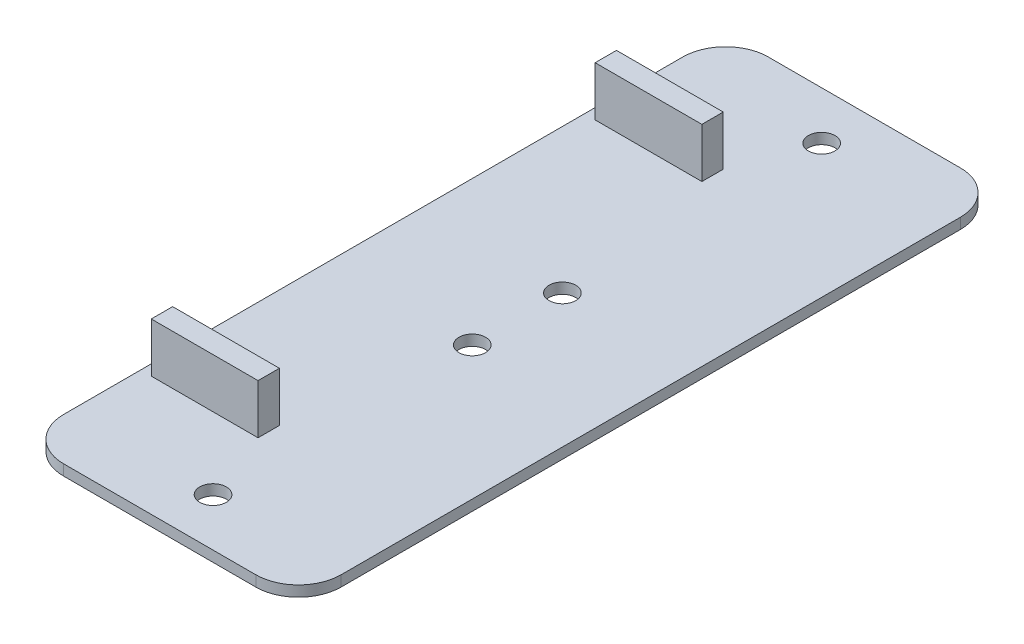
ISO-10303-21;
HEADER;
FILE_DESCRIPTION(('STEP AP214'),'2;1');
FILE_NAME('part.step','',(''),(''),'','','');
FILE_SCHEMA(('AUTOMOTIVE_DESIGN { 1 0 10303 214 1 1 1 1 }'));
ENDSEC;
DATA;
#1=APPLICATION_CONTEXT('core data for automotive mechanical design processes');
#2=APPLICATION_PROTOCOL_DEFINITION('international standard','automotive_design',2000,#1);
#3=PRODUCT_CONTEXT('',#1,'mechanical');
#4=PRODUCT('Part','Part','',(#3));
#5=PRODUCT_RELATED_PRODUCT_CATEGORY('part','',(#4));
#6=PRODUCT_DEFINITION_FORMATION('','',#4);
#7=PRODUCT_DEFINITION_CONTEXT('part definition',#1,'design');
#8=PRODUCT_DEFINITION('design','',#6,#7);
#9=PRODUCT_DEFINITION_SHAPE('','',#8);
#10=(LENGTH_UNIT() NAMED_UNIT(*) SI_UNIT(.MILLI.,.METRE.));
#11=(NAMED_UNIT(*) PLANE_ANGLE_UNIT() SI_UNIT($,.RADIAN.));
#12=(NAMED_UNIT(*) SI_UNIT($,.STERADIAN.) SOLID_ANGLE_UNIT());
#13=UNCERTAINTY_MEASURE_WITH_UNIT(LENGTH_MEASURE(1.E-05),#10,'distance_accuracy_value','');
#14=(GEOMETRIC_REPRESENTATION_CONTEXT(3) GLOBAL_UNCERTAINTY_ASSIGNED_CONTEXT((#13)) GLOBAL_UNIT_ASSIGNED_CONTEXT((#10,
#11,#12)) REPRESENTATION_CONTEXT('',''));
#15=CARTESIAN_POINT('',(0.,0.,0.));
#16=DIRECTION('',(0.,0.,1.));
#17=DIRECTION('',(1.,0.,0.));
#18=AXIS2_PLACEMENT_3D('',#15,#16,#17);
#19=CARTESIAN_POINT('',(0.,1.27,0.));
#20=DIRECTION('',(0.,-1.,0.));
#21=DIRECTION('',(0.,0.,-1.));
#22=AXIS2_PLACEMENT_3D('',#19,#20,#21);
#23=PLANE('',#22);
#24=DIRECTION('',(0.,0.,-1.));
#25=VECTOR('',#24,1.);
#26=CARTESIAN_POINT('',(13.97,1.27,-14.2430500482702));
#27=LINE('',#26,#25);
#28=CARTESIAN_POINT('',(13.97,1.27,-14.2430500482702));
#29=VERTEX_POINT('',#28);
#30=CARTESIAN_POINT('',(13.97,1.27,-16.7830500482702));
#31=VERTEX_POINT('',#30);
#32=EDGE_CURVE('E155',#29,#31,#27,.T.);
#33=ORIENTED_EDGE('',*,*,#32,.F.);
#34=DIRECTION('',(1.,0.,0.));
#35=VECTOR('',#34,1.);
#36=CARTESIAN_POINT('',(1.27,1.27,-14.2430500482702));
#37=LINE('',#36,#35);
#38=CARTESIAN_POINT('',(1.27,1.27,-14.2430500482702));
#39=VERTEX_POINT('',#38);
#40=EDGE_CURVE('E188',#39,#29,#37,.T.);
#41=ORIENTED_EDGE('',*,*,#40,.F.);
#42=DIRECTION('',(0.,0.,1.));
#43=VECTOR('',#42,1.);
#44=CARTESIAN_POINT('',(1.27,1.27,-16.7830500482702));
#45=LINE('',#44,#43);
#46=CARTESIAN_POINT('',(1.27,1.27,-16.7830500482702));
#47=VERTEX_POINT('',#46);
#48=EDGE_CURVE('E200',#47,#39,#45,.T.);
#49=ORIENTED_EDGE('',*,*,#48,.F.);
#50=DIRECTION('',(-1.,0.,0.));
#51=VECTOR('',#50,1.);
#52=CARTESIAN_POINT('',(13.97,1.27,-16.7830500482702));
#53=LINE('',#52,#51);
#54=EDGE_CURVE('E197',#31,#47,#53,.T.);
#55=ORIENTED_EDGE('',*,*,#54,.F.);
#56=EDGE_LOOP('',(#33,#41,#49,#55));
#57=FACE_BOUND('',#56,.T.);
#58=CARTESIAN_POINT('',(17.145,1.27,-78.105));
#59=DIRECTION('',(0.,-1.,0.));
#60=DIRECTION('',(0.,0.,-1.));
#61=AXIS2_PLACEMENT_3D('',#58,#59,#60);
#62=CIRCLE('',#61,1.5875);
#63=CARTESIAN_POINT('',(17.145,1.27,-79.6925));
#64=VERTEX_POINT('',#63);
#65=EDGE_CURVE('E237',#64,#64,#62,.F.);
#66=ORIENTED_EDGE('',*,*,#65,.F.);
#67=EDGE_LOOP('',(#66));
#68=FACE_BOUND('',#67,.T.);
#69=CARTESIAN_POINT('',(17.145,1.27,-47.2694));
#70=DIRECTION('',(0.,-1.,0.));
#71=DIRECTION('',(0.,0.,-1.));
#72=AXIS2_PLACEMENT_3D('',#69,#70,#71);
#73=CIRCLE('',#72,1.5875);
#74=CARTESIAN_POINT('',(17.145,1.27,-48.8569));
#75=VERTEX_POINT('',#74);
#76=EDGE_CURVE('E234',#75,#75,#73,.F.);
#77=ORIENTED_EDGE('',*,*,#76,.F.);
#78=EDGE_LOOP('',(#77));
#79=FACE_BOUND('',#78,.T.);
#80=CARTESIAN_POINT('',(17.145,1.27,-36.5506000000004));
#81=DIRECTION('',(0.,-1.,0.));
#82=DIRECTION('',(0.,0.,-1.));
#83=AXIS2_PLACEMENT_3D('',#80,#81,#82);
#84=CIRCLE('',#83,1.5875);
#85=CARTESIAN_POINT('',(17.145,1.27,-38.1381000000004));
#86=VERTEX_POINT('',#85);
#87=EDGE_CURVE('E231',#86,#86,#84,.F.);
#88=ORIENTED_EDGE('',*,*,#87,.F.);
#89=EDGE_LOOP('',(#88));
#90=FACE_BOUND('',#89,.T.);
#91=CARTESIAN_POINT('',(17.145,1.27,-5.71500000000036));
#92=DIRECTION('',(0.,-1.,0.));
#93=DIRECTION('',(0.,0.,-1.));
#94=AXIS2_PLACEMENT_3D('',#91,#92,#93);
#95=CIRCLE('',#94,1.5875);
#96=CARTESIAN_POINT('',(17.145,1.27,-7.30250000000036));
#97=VERTEX_POINT('',#96);
#98=EDGE_CURVE('E220',#97,#97,#95,.F.);
#99=ORIENTED_EDGE('',*,*,#98,.F.);
#100=EDGE_LOOP('',(#99));
#101=FACE_BOUND('',#100,.T.);
#102=DIRECTION('',(-1.,0.,0.));
#103=VECTOR('',#102,1.);
#104=CARTESIAN_POINT('',(0.,1.27,-83.82));
#105=LINE('',#104,#103);
#106=CARTESIAN_POINT('',(27.94,1.27,-83.82));
#107=VERTEX_POINT('',#106);
#108=CARTESIAN_POINT('',(5.08,1.27,-83.82));
#109=VERTEX_POINT('',#108);
#110=EDGE_CURVE('E250',#107,#109,#105,.T.);
#111=ORIENTED_EDGE('',*,*,#110,.T.);
#112=CARTESIAN_POINT('',(5.08,1.27,-78.74));
#113=DIRECTION('',(0.,-1.,0.));
#114=DIRECTION('',(0.,0.,-1.));
#115=AXIS2_PLACEMENT_3D('',#112,#113,#114);
#116=CIRCLE('',#115,5.08);
#117=CARTESIAN_POINT('',(0.,1.27,-78.74));
#118=VERTEX_POINT('',#117);
#119=EDGE_CURVE('E11',#109,#118,#116,.F.);
#120=ORIENTED_EDGE('',*,*,#119,.T.);
#121=DIRECTION('',(0.,0.,1.));
#122=VECTOR('',#121,1.);
#123=CARTESIAN_POINT('',(0.,1.27,0.));
#124=LINE('',#123,#122);
#125=CARTESIAN_POINT('',(0.,1.27,-5.08));
#126=VERTEX_POINT('',#125);
#127=EDGE_CURVE('E241',#118,#126,#124,.T.);
#128=ORIENTED_EDGE('',*,*,#127,.T.);
#129=CARTESIAN_POINT('',(5.08,1.27,-5.08));
#130=DIRECTION('',(0.,-1.,0.));
#131=DIRECTION('',(0.,0.,-1.));
#132=AXIS2_PLACEMENT_3D('',#129,#130,#131);
#133=CIRCLE('',#132,5.08);
#134=CARTESIAN_POINT('',(5.08,1.27,0.));
#135=VERTEX_POINT('',#134);
#136=EDGE_CURVE('E268',#126,#135,#133,.F.);
#137=ORIENTED_EDGE('',*,*,#136,.T.);
#138=DIRECTION('',(1.,0.,0.));
#139=VECTOR('',#138,1.);
#140=CARTESIAN_POINT('',(0.,1.27,0.));
#141=LINE('',#140,#139);
#142=CARTESIAN_POINT('',(27.94,1.27,0.));
#143=VERTEX_POINT('',#142);
#144=EDGE_CURVE('E243',#135,#143,#141,.T.);
#145=ORIENTED_EDGE('',*,*,#144,.T.);
#146=CARTESIAN_POINT('',(27.94,1.27,-5.08));
#147=DIRECTION('',(0.,-1.,0.));
#148=DIRECTION('',(0.,0.,-1.));
#149=AXIS2_PLACEMENT_3D('',#146,#147,#148);
#150=CIRCLE('',#149,5.08);
#151=CARTESIAN_POINT('',(33.02,1.27,-5.08));
#152=VERTEX_POINT('',#151);
#153=EDGE_CURVE('E281',#143,#152,#150,.F.);
#154=ORIENTED_EDGE('',*,*,#153,.T.);
#155=DIRECTION('',(0.,0.,-1.));
#156=VECTOR('',#155,1.);
#157=CARTESIAN_POINT('',(33.02,1.27,0.));
#158=LINE('',#157,#156);
#159=CARTESIAN_POINT('',(33.02,1.27,-78.74));
#160=VERTEX_POINT('',#159);
#161=EDGE_CURVE('E247',#152,#160,#158,.T.);
#162=ORIENTED_EDGE('',*,*,#161,.T.);
#163=CARTESIAN_POINT('',(27.94,1.27,-78.74));
#164=DIRECTION('',(0.,-1.,0.));
#165=DIRECTION('',(0.,0.,-1.));
#166=AXIS2_PLACEMENT_3D('',#163,#164,#165);
#167=CIRCLE('',#166,5.08);
#168=EDGE_CURVE('E291',#160,#107,#167,.F.);
#169=ORIENTED_EDGE('',*,*,#168,.T.);
#170=EDGE_LOOP('',(#111,#120,#128,#137,#145,#154,#162,#169));
#171=FACE_BOUND('',#170,.T.);
#172=DIRECTION('',(1.,0.,0.));
#173=VECTOR('',#172,1.);
#174=CARTESIAN_POINT('',(1.27,1.27,-67.03695));
#175=LINE('',#174,#173);
#176=CARTESIAN_POINT('',(1.27,1.27,-67.03695));
#177=VERTEX_POINT('',#176);
#178=CARTESIAN_POINT('',(13.97,1.27,-67.03695));
#179=VERTEX_POINT('',#178);
#180=EDGE_CURVE('E149',#177,#179,#175,.T.);
#181=ORIENTED_EDGE('',*,*,#180,.F.);
#182=DIRECTION('',(0.,0.,1.));
#183=VECTOR('',#182,1.);
#184=CARTESIAN_POINT('',(1.27,1.27,-69.57695));
#185=LINE('',#184,#183);
#186=CARTESIAN_POINT('',(1.27,1.27,-69.57695));
#187=VERTEX_POINT('',#186);
#188=EDGE_CURVE('E151',#187,#177,#185,.T.);
#189=ORIENTED_EDGE('',*,*,#188,.F.);
#190=DIRECTION('',(-1.,0.,0.));
#191=VECTOR('',#190,1.);
#192=CARTESIAN_POINT('',(13.97,1.27,-69.57695));
#193=LINE('',#192,#191);
#194=CARTESIAN_POINT('',(13.97,1.27,-69.57695));
#195=VERTEX_POINT('',#194);
#196=EDGE_CURVE('E61',#195,#187,#193,.T.);
#197=ORIENTED_EDGE('',*,*,#196,.F.);
#198=DIRECTION('',(0.,0.,-1.));
#199=VECTOR('',#198,1.);
#200=CARTESIAN_POINT('',(13.97,1.27,-67.03695));
#201=LINE('',#200,#199);
#202=EDGE_CURVE('E56',#179,#195,#201,.T.);
#203=ORIENTED_EDGE('',*,*,#202,.F.);
#204=EDGE_LOOP('',(#181,#189,#197,#203));
#205=FACE_BOUND('',#204,.T.);
#206=ADVANCED_FACE('F41',(#57,#68,#79,#90,#101,#171,#205),#23,.F.);
#207=CARTESIAN_POINT('',(5.08,1.27,-78.74));
#208=DIRECTION('',(0.,1.,0.));
#209=DIRECTION('',(0.,0.,1.));
#210=AXIS2_PLACEMENT_3D('',#207,#208,#209);
#211=CYLINDRICAL_SURFACE('',#210,5.08);
#212=DIRECTION('',(0.,1.,0.));
#213=VECTOR('',#212,1.);
#214=CARTESIAN_POINT('',(5.08,1.27,-83.82));
#215=LINE('',#214,#213);
#216=CARTESIAN_POINT('',(5.08,0.,-83.82));
#217=VERTEX_POINT('',#216);
#218=EDGE_CURVE('E293',#217,#109,#215,.T.);
#219=ORIENTED_EDGE('',*,*,#218,.F.);
#220=CARTESIAN_POINT('',(5.08,0.,-78.74));
#221=DIRECTION('',(0.,-1.,0.));
#222=DIRECTION('',(0.,0.,-1.));
#223=AXIS2_PLACEMENT_3D('',#220,#221,#222);
#224=CIRCLE('',#223,5.08);
#225=CARTESIAN_POINT('',(0.,0.,-78.74));
#226=VERTEX_POINT('',#225);
#227=EDGE_CURVE('E49',#226,#217,#224,.T.);
#228=ORIENTED_EDGE('',*,*,#227,.F.);
#229=DIRECTION('',(0.,1.,0.));
#230=VECTOR('',#229,1.);
#231=CARTESIAN_POINT('',(0.,1.27,-78.74));
#232=LINE('',#231,#230);
#233=EDGE_CURVE('E296',#118,#226,#232,.F.);
#234=ORIENTED_EDGE('',*,*,#233,.F.);
#235=ORIENTED_EDGE('',*,*,#119,.F.);
#236=EDGE_LOOP('',(#219,#228,#234,#235));
#237=FACE_BOUND('',#236,.T.);
#238=ADVANCED_FACE('F43',(#237),#211,.T.);
#239=CARTESIAN_POINT('',(27.94,1.27,-78.74));
#240=DIRECTION('',(0.,1.,0.));
#241=DIRECTION('',(0.,0.,1.));
#242=AXIS2_PLACEMENT_3D('',#239,#240,#241);
#243=CYLINDRICAL_SURFACE('',#242,5.08);
#244=DIRECTION('',(0.,1.,0.));
#245=VECTOR('',#244,1.);
#246=CARTESIAN_POINT('',(33.02,1.27,-78.74));
#247=LINE('',#246,#245);
#248=CARTESIAN_POINT('',(33.02,0.,-78.74));
#249=VERTEX_POINT('',#248);
#250=EDGE_CURVE('E283',#249,#160,#247,.T.);
#251=ORIENTED_EDGE('',*,*,#250,.F.);
#252=CARTESIAN_POINT('',(27.94,0.,-78.74));
#253=DIRECTION('',(0.,-1.,0.));
#254=DIRECTION('',(0.,0.,-1.));
#255=AXIS2_PLACEMENT_3D('',#252,#253,#254);
#256=CIRCLE('',#255,5.08);
#257=CARTESIAN_POINT('',(27.94,0.,-83.82));
#258=VERTEX_POINT('',#257);
#259=EDGE_CURVE('E289',#258,#249,#256,.T.);
#260=ORIENTED_EDGE('',*,*,#259,.F.);
#261=DIRECTION('',(0.,1.,0.));
#262=VECTOR('',#261,1.);
#263=CARTESIAN_POINT('',(27.94,1.27,-83.82));
#264=LINE('',#263,#262);
#265=EDGE_CURVE('E286',#107,#258,#264,.F.);
#266=ORIENTED_EDGE('',*,*,#265,.F.);
#267=ORIENTED_EDGE('',*,*,#168,.F.);
#268=EDGE_LOOP('',(#251,#260,#266,#267));
#269=FACE_BOUND('',#268,.T.);
#270=ADVANCED_FACE('F311',(#269),#243,.T.);
#271=CARTESIAN_POINT('',(27.94,1.27,-5.08));
#272=DIRECTION('',(0.,1.,0.));
#273=DIRECTION('',(0.,0.,1.));
#274=AXIS2_PLACEMENT_3D('',#271,#272,#273);
#275=CYLINDRICAL_SURFACE('',#274,5.08);
#276=DIRECTION('',(0.,1.,0.));
#277=VECTOR('',#276,1.);
#278=CARTESIAN_POINT('',(27.94,1.27,0.));
#279=LINE('',#278,#277);
#280=CARTESIAN_POINT('',(27.94,0.,0.));
#281=VERTEX_POINT('',#280);
#282=EDGE_CURVE('E273',#281,#143,#279,.T.);
#283=ORIENTED_EDGE('',*,*,#282,.F.);
#284=CARTESIAN_POINT('',(27.94,0.,-5.08));
#285=DIRECTION('',(0.,-1.,0.));
#286=DIRECTION('',(0.,0.,-1.));
#287=AXIS2_PLACEMENT_3D('',#284,#285,#286);
#288=CIRCLE('',#287,5.08);
#289=CARTESIAN_POINT('',(33.02,0.,-5.08));
#290=VERTEX_POINT('',#289);
#291=EDGE_CURVE('E279',#290,#281,#288,.T.);
#292=ORIENTED_EDGE('',*,*,#291,.F.);
#293=DIRECTION('',(0.,1.,0.));
#294=VECTOR('',#293,1.);
#295=CARTESIAN_POINT('',(33.02,1.27,-5.08));
#296=LINE('',#295,#294);
#297=EDGE_CURVE('E276',#152,#290,#296,.F.);
#298=ORIENTED_EDGE('',*,*,#297,.F.);
#299=ORIENTED_EDGE('',*,*,#153,.F.);
#300=EDGE_LOOP('',(#283,#292,#298,#299));
#301=FACE_BOUND('',#300,.T.);
#302=ADVANCED_FACE('F320',(#301),#275,.T.);
#303=CARTESIAN_POINT('',(5.08,1.27,-5.08));
#304=DIRECTION('',(0.,-1.,0.));
#305=DIRECTION('',(0.,0.,-1.));
#306=AXIS2_PLACEMENT_3D('',#303,#304,#305);
#307=CYLINDRICAL_SURFACE('',#306,5.08);
#308=DIRECTION('',(0.,-1.,0.));
#309=VECTOR('',#308,1.);
#310=CARTESIAN_POINT('',(5.08,1.27,0.));
#311=LINE('',#310,#309);
#312=CARTESIAN_POINT('',(5.08,0.,0.));
#313=VERTEX_POINT('',#312);
#314=EDGE_CURVE('E253',#135,#313,#311,.T.);
#315=ORIENTED_EDGE('',*,*,#314,.F.);
#316=ORIENTED_EDGE('',*,*,#136,.F.);
#317=DIRECTION('',(0.,-1.,0.));
#318=VECTOR('',#317,1.);
#319=CARTESIAN_POINT('',(0.,1.27,-5.08));
#320=LINE('',#319,#318);
#321=CARTESIAN_POINT('',(0.,0.,-5.08));
#322=VERTEX_POINT('',#321);
#323=EDGE_CURVE('E265',#322,#126,#320,.F.);
#324=ORIENTED_EDGE('',*,*,#323,.F.);
#325=CARTESIAN_POINT('',(5.08,0.,-5.08));
#326=DIRECTION('',(0.,-1.,0.));
#327=DIRECTION('',(0.,0.,-1.));
#328=AXIS2_PLACEMENT_3D('',#325,#326,#327);
#329=CIRCLE('',#328,5.08);
#330=EDGE_CURVE('E270',#313,#322,#329,.T.);
#331=ORIENTED_EDGE('',*,*,#330,.F.);
#332=EDGE_LOOP('',(#315,#316,#324,#331));
#333=FACE_BOUND('',#332,.T.);
#334=ADVANCED_FACE('F328',(#333),#307,.T.);
#335=CARTESIAN_POINT('',(0.,1.27,0.));
#336=DIRECTION('',(1.,0.,0.));
#337=DIRECTION('',(0.,0.,-1.));
#338=AXIS2_PLACEMENT_3D('',#335,#336,#337);
#339=PLANE('',#338);
#340=ORIENTED_EDGE('',*,*,#127,.F.);
#341=ORIENTED_EDGE('',*,*,#233,.T.);
#342=DIRECTION('',(0.,0.,1.));
#343=VECTOR('',#342,1.);
#344=CARTESIAN_POINT('',(0.,0.,0.));
#345=LINE('',#344,#343);
#346=EDGE_CURVE('E240',#226,#322,#345,.T.);
#347=ORIENTED_EDGE('',*,*,#346,.T.);
#348=ORIENTED_EDGE('',*,*,#323,.T.);
#349=EDGE_LOOP('',(#340,#341,#347,#348));
#350=FACE_BOUND('',#349,.T.);
#351=ADVANCED_FACE('F331',(#350),#339,.F.);
#352=CARTESIAN_POINT('',(0.,1.27,0.));
#353=DIRECTION('',(0.,0.,-1.));
#354=DIRECTION('',(-1.,0.,0.));
#355=AXIS2_PLACEMENT_3D('',#352,#353,#354);
#356=PLANE('',#355);
#357=DIRECTION('',(1.,0.,0.));
#358=VECTOR('',#357,1.);
#359=CARTESIAN_POINT('',(0.,0.,0.));
#360=LINE('',#359,#358);
#361=EDGE_CURVE('E255',#313,#281,#360,.T.);
#362=ORIENTED_EDGE('',*,*,#361,.T.);
#363=ORIENTED_EDGE('',*,*,#282,.T.);
#364=ORIENTED_EDGE('',*,*,#144,.F.);
#365=ORIENTED_EDGE('',*,*,#314,.T.);
#366=EDGE_LOOP('',(#362,#363,#364,#365));
#367=FACE_BOUND('',#366,.T.);
#368=ADVANCED_FACE('F323',(#367),#356,.F.);
#369=CARTESIAN_POINT('',(33.02,1.27,0.));
#370=DIRECTION('',(-1.,0.,0.));
#371=DIRECTION('',(0.,0.,1.));
#372=AXIS2_PLACEMENT_3D('',#369,#370,#371);
#373=PLANE('',#372);
#374=DIRECTION('',(0.,0.,-1.));
#375=VECTOR('',#374,1.);
#376=CARTESIAN_POINT('',(33.02,0.,0.));
#377=LINE('',#376,#375);
#378=EDGE_CURVE('E258',#290,#249,#377,.T.);
#379=ORIENTED_EDGE('',*,*,#378,.T.);
#380=ORIENTED_EDGE('',*,*,#250,.T.);
#381=ORIENTED_EDGE('',*,*,#161,.F.);
#382=ORIENTED_EDGE('',*,*,#297,.T.);
#383=EDGE_LOOP('',(#379,#380,#381,#382));
#384=FACE_BOUND('',#383,.T.);
#385=ADVANCED_FACE('F316',(#384),#373,.F.);
#386=CARTESIAN_POINT('',(0.,1.27,-83.82));
#387=DIRECTION('',(0.,0.,1.));
#388=DIRECTION('',(1.,0.,0.));
#389=AXIS2_PLACEMENT_3D('',#386,#387,#388);
#390=PLANE('',#389);
#391=DIRECTION('',(-1.,0.,0.));
#392=VECTOR('',#391,1.);
#393=CARTESIAN_POINT('',(0.,0.,-83.82));
#394=LINE('',#393,#392);
#395=EDGE_CURVE('E244',#258,#217,#394,.T.);
#396=ORIENTED_EDGE('',*,*,#395,.T.);
#397=ORIENTED_EDGE('',*,*,#218,.T.);
#398=ORIENTED_EDGE('',*,*,#110,.F.);
#399=ORIENTED_EDGE('',*,*,#265,.T.);
#400=EDGE_LOOP('',(#396,#397,#398,#399));
#401=FACE_BOUND('',#400,.T.);
#402=ADVANCED_FACE('F307',(#401),#390,.F.);
#403=CARTESIAN_POINT('',(0.,0.,0.));
#404=DIRECTION('',(0.,-1.,0.));
#405=DIRECTION('',(0.,0.,-1.));
#406=AXIS2_PLACEMENT_3D('',#403,#404,#405);
#407=PLANE('',#406);
#408=CARTESIAN_POINT('',(17.145,0.,-78.105));
#409=DIRECTION('',(0.,-1.,0.));
#410=DIRECTION('',(0.,0.,-1.));
#411=AXIS2_PLACEMENT_3D('',#408,#409,#410);
#412=CIRCLE('',#411,1.5875);
#413=CARTESIAN_POINT('',(17.145,0.,-79.6925));
#414=VERTEX_POINT('',#413);
#415=EDGE_CURVE('E217',#414,#414,#412,.T.);
#416=ORIENTED_EDGE('',*,*,#415,.F.);
#417=EDGE_LOOP('',(#416));
#418=FACE_BOUND('',#417,.T.);
#419=CARTESIAN_POINT('',(17.145,0.,-47.2694));
#420=DIRECTION('',(0.,-1.,0.));
#421=DIRECTION('',(0.,0.,-1.));
#422=AXIS2_PLACEMENT_3D('',#419,#420,#421);
#423=CIRCLE('',#422,1.5875);
#424=CARTESIAN_POINT('',(17.145,0.,-48.8569));
#425=VERTEX_POINT('',#424);
#426=EDGE_CURVE('E221',#425,#425,#423,.T.);
#427=ORIENTED_EDGE('',*,*,#426,.F.);
#428=EDGE_LOOP('',(#427));
#429=FACE_BOUND('',#428,.T.);
#430=CARTESIAN_POINT('',(17.145,0.,-36.5506000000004));
#431=DIRECTION('',(0.,-1.,0.));
#432=DIRECTION('',(0.,0.,-1.));
#433=AXIS2_PLACEMENT_3D('',#430,#431,#432);
#434=CIRCLE('',#433,1.5875);
#435=CARTESIAN_POINT('',(17.145,0.,-38.1381000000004));
#436=VERTEX_POINT('',#435);
#437=EDGE_CURVE('E224',#436,#436,#434,.T.);
#438=ORIENTED_EDGE('',*,*,#437,.F.);
#439=EDGE_LOOP('',(#438));
#440=FACE_BOUND('',#439,.T.);
#441=CARTESIAN_POINT('',(17.145,0.,-5.71500000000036));
#442=DIRECTION('',(0.,-1.,0.));
#443=DIRECTION('',(0.,0.,-1.));
#444=AXIS2_PLACEMENT_3D('',#441,#442,#443);
#445=CIRCLE('',#444,1.5875);
#446=CARTESIAN_POINT('',(17.145,0.,-7.30250000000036));
#447=VERTEX_POINT('',#446);
#448=EDGE_CURVE('E216',#447,#447,#445,.T.);
#449=ORIENTED_EDGE('',*,*,#448,.F.);
#450=EDGE_LOOP('',(#449));
#451=FACE_BOUND('',#450,.T.);
#452=ORIENTED_EDGE('',*,*,#346,.F.);
#453=ORIENTED_EDGE('',*,*,#227,.T.);
#454=ORIENTED_EDGE('',*,*,#395,.F.);
#455=ORIENTED_EDGE('',*,*,#259,.T.);
#456=ORIENTED_EDGE('',*,*,#378,.F.);
#457=ORIENTED_EDGE('',*,*,#291,.T.);
#458=ORIENTED_EDGE('',*,*,#361,.F.);
#459=ORIENTED_EDGE('',*,*,#330,.T.);
#460=EDGE_LOOP('',(#452,#453,#454,#455,#456,#457,#458,#459));
#461=FACE_BOUND('',#460,.T.);
#462=ADVANCED_FACE('F302',(#418,#429,#440,#451,#461),#407,.T.);
#463=CARTESIAN_POINT('',(17.145,0.,-5.71500000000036));
#464=DIRECTION('',(0.,1.,0.));
#465=DIRECTION('',(0.,0.,1.));
#466=AXIS2_PLACEMENT_3D('',#463,#464,#465);
#467=CYLINDRICAL_SURFACE('',#466,1.5875);
#468=ORIENTED_EDGE('',*,*,#448,.T.);
#469=EDGE_LOOP('',(#468));
#470=FACE_BOUND('',#469,.T.);
#471=ORIENTED_EDGE('',*,*,#98,.T.);
#472=EDGE_LOOP('',(#471));
#473=FACE_BOUND('',#472,.T.);
#474=ADVANCED_FACE('F342',(#470,#473),#467,.F.);
#475=CARTESIAN_POINT('',(17.145,0.,-36.5506000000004));
#476=DIRECTION('',(0.,1.,0.));
#477=DIRECTION('',(0.,0.,1.));
#478=AXIS2_PLACEMENT_3D('',#475,#476,#477);
#479=CYLINDRICAL_SURFACE('',#478,1.5875);
#480=ORIENTED_EDGE('',*,*,#437,.T.);
#481=EDGE_LOOP('',(#480));
#482=FACE_BOUND('',#481,.T.);
#483=ORIENTED_EDGE('',*,*,#87,.T.);
#484=EDGE_LOOP('',(#483));
#485=FACE_BOUND('',#484,.T.);
#486=ADVANCED_FACE('F398',(#482,#485),#479,.F.);
#487=CARTESIAN_POINT('',(17.145,0.,-47.2694));
#488=DIRECTION('',(0.,1.,0.));
#489=DIRECTION('',(0.,0.,1.));
#490=AXIS2_PLACEMENT_3D('',#487,#488,#489);
#491=CYLINDRICAL_SURFACE('',#490,1.5875);
#492=ORIENTED_EDGE('',*,*,#426,.T.);
#493=EDGE_LOOP('',(#492));
#494=FACE_BOUND('',#493,.T.);
#495=ORIENTED_EDGE('',*,*,#76,.T.);
#496=EDGE_LOOP('',(#495));
#497=FACE_BOUND('',#496,.T.);
#498=ADVANCED_FACE('F405',(#494,#497),#491,.F.);
#499=CARTESIAN_POINT('',(17.145,0.,-78.105));
#500=DIRECTION('',(0.,1.,0.));
#501=DIRECTION('',(0.,0.,1.));
#502=AXIS2_PLACEMENT_3D('',#499,#500,#501);
#503=CYLINDRICAL_SURFACE('',#502,1.5875);
#504=ORIENTED_EDGE('',*,*,#415,.T.);
#505=EDGE_LOOP('',(#504));
#506=FACE_BOUND('',#505,.T.);
#507=ORIENTED_EDGE('',*,*,#65,.T.);
#508=EDGE_LOOP('',(#507));
#509=FACE_BOUND('',#508,.T.);
#510=ADVANCED_FACE('F412',(#506,#509),#503,.F.);
#511=CARTESIAN_POINT('',(13.97,7.1628,-14.2430500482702));
#512=DIRECTION('',(-1.,0.,0.));
#513=DIRECTION('',(0.,0.,1.));
#514=AXIS2_PLACEMENT_3D('',#511,#512,#513);
#515=PLANE('',#514);
#516=ORIENTED_EDGE('',*,*,#32,.T.);
#517=DIRECTION('',(0.,-1.,0.));
#518=VECTOR('',#517,1.);
#519=CARTESIAN_POINT('',(13.97,7.1628,-16.7830500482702));
#520=LINE('',#519,#518);
#521=CARTESIAN_POINT('',(13.97,7.1628,-16.7830500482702));
#522=VERTEX_POINT('',#521);
#523=EDGE_CURVE('E213',#522,#31,#520,.T.);
#524=ORIENTED_EDGE('',*,*,#523,.F.);
#525=DIRECTION('',(0.,0.,-1.));
#526=VECTOR('',#525,1.);
#527=CARTESIAN_POINT('',(13.97,7.1628,-14.2430500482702));
#528=LINE('',#527,#526);
#529=CARTESIAN_POINT('',(13.97,7.1628,-14.2430500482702));
#530=VERTEX_POINT('',#529);
#531=EDGE_CURVE('E184',#530,#522,#528,.T.);
#532=ORIENTED_EDGE('',*,*,#531,.F.);
#533=DIRECTION('',(0.,-1.,0.));
#534=VECTOR('',#533,1.);
#535=CARTESIAN_POINT('',(13.97,7.1628,-14.2430500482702));
#536=LINE('',#535,#534);
#537=EDGE_CURVE('E194',#530,#29,#536,.T.);
#538=ORIENTED_EDGE('',*,*,#537,.T.);
#539=EDGE_LOOP('',(#516,#524,#532,#538));
#540=FACE_BOUND('',#539,.T.);
#541=ADVANCED_FACE('F419',(#540),#515,.F.);
#542=CARTESIAN_POINT('',(13.97,7.1628,-16.7830500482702));
#543=DIRECTION('',(0.,0.,1.));
#544=DIRECTION('',(1.,0.,0.));
#545=AXIS2_PLACEMENT_3D('',#542,#543,#544);
#546=PLANE('',#545);
#547=ORIENTED_EDGE('',*,*,#54,.T.);
#548=DIRECTION('',(0.,-1.,0.));
#549=VECTOR('',#548,1.);
#550=CARTESIAN_POINT('',(1.27,7.1628,-16.7830500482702));
#551=LINE('',#550,#549);
#552=CARTESIAN_POINT('',(1.27,7.1628,-16.7830500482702));
#553=VERTEX_POINT('',#552);
#554=EDGE_CURVE('E210',#553,#47,#551,.T.);
#555=ORIENTED_EDGE('',*,*,#554,.F.);
#556=DIRECTION('',(-1.,0.,0.));
#557=VECTOR('',#556,1.);
#558=CARTESIAN_POINT('',(13.97,7.1628,-16.7830500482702));
#559=LINE('',#558,#557);
#560=EDGE_CURVE('E187',#522,#553,#559,.T.);
#561=ORIENTED_EDGE('',*,*,#560,.F.);
#562=ORIENTED_EDGE('',*,*,#523,.T.);
#563=EDGE_LOOP('',(#547,#555,#561,#562));
#564=FACE_BOUND('',#563,.T.);
#565=ADVANCED_FACE('F427',(#564),#546,.F.);
#566=CARTESIAN_POINT('',(1.27,7.1628,-16.7830500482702));
#567=DIRECTION('',(1.,0.,0.));
#568=DIRECTION('',(0.,0.,-1.));
#569=AXIS2_PLACEMENT_3D('',#566,#567,#568);
#570=PLANE('',#569);
#571=ORIENTED_EDGE('',*,*,#48,.T.);
#572=DIRECTION('',(0.,-1.,0.));
#573=VECTOR('',#572,1.);
#574=CARTESIAN_POINT('',(1.27,7.1628,-14.2430500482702));
#575=LINE('',#574,#573);
#576=CARTESIAN_POINT('',(1.27,7.1628,-14.2430500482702));
#577=VERTEX_POINT('',#576);
#578=EDGE_CURVE('E207',#577,#39,#575,.T.);
#579=ORIENTED_EDGE('',*,*,#578,.F.);
#580=DIRECTION('',(0.,0.,1.));
#581=VECTOR('',#580,1.);
#582=CARTESIAN_POINT('',(1.27,7.1628,-16.7830500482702));
#583=LINE('',#582,#581);
#584=EDGE_CURVE('E190',#553,#577,#583,.T.);
#585=ORIENTED_EDGE('',*,*,#584,.F.);
#586=ORIENTED_EDGE('',*,*,#554,.T.);
#587=EDGE_LOOP('',(#571,#579,#585,#586));
#588=FACE_BOUND('',#587,.T.);
#589=ADVANCED_FACE('F435',(#588),#570,.F.);
#590=CARTESIAN_POINT('',(1.27,7.1628,-14.2430500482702));
#591=DIRECTION('',(0.,0.,-1.));
#592=DIRECTION('',(-1.,0.,0.));
#593=AXIS2_PLACEMENT_3D('',#590,#591,#592);
#594=PLANE('',#593);
#595=ORIENTED_EDGE('',*,*,#40,.T.);
#596=ORIENTED_EDGE('',*,*,#537,.F.);
#597=DIRECTION('',(1.,0.,0.));
#598=VECTOR('',#597,1.);
#599=CARTESIAN_POINT('',(1.27,7.1628,-14.2430500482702));
#600=LINE('',#599,#598);
#601=EDGE_CURVE('E192',#577,#530,#600,.T.);
#602=ORIENTED_EDGE('',*,*,#601,.F.);
#603=ORIENTED_EDGE('',*,*,#578,.T.);
#604=EDGE_LOOP('',(#595,#596,#602,#603));
#605=FACE_BOUND('',#604,.T.);
#606=ADVANCED_FACE('F443',(#605),#594,.F.);
#607=CARTESIAN_POINT('',(0.,7.1628,0.));
#608=DIRECTION('',(0.,1.,0.));
#609=DIRECTION('',(0.,0.,1.));
#610=AXIS2_PLACEMENT_3D('',#607,#608,#609);
#611=PLANE('',#610);
#612=ORIENTED_EDGE('',*,*,#531,.T.);
#613=ORIENTED_EDGE('',*,*,#560,.T.);
#614=ORIENTED_EDGE('',*,*,#584,.T.);
#615=ORIENTED_EDGE('',*,*,#601,.T.);
#616=EDGE_LOOP('',(#612,#613,#614,#615));
#617=FACE_BOUND('',#616,.T.);
#618=ADVANCED_FACE('F451',(#617),#611,.T.);
#619=CARTESIAN_POINT('',(1.27,7.1628,-67.03695));
#620=DIRECTION('',(0.,0.,-1.));
#621=DIRECTION('',(-1.,0.,0.));
#622=AXIS2_PLACEMENT_3D('',#619,#620,#621);
#623=PLANE('',#622);
#624=ORIENTED_EDGE('',*,*,#180,.T.);
#625=DIRECTION('',(0.,-1.,0.));
#626=VECTOR('',#625,1.);
#627=CARTESIAN_POINT('',(13.97,7.1628,-67.03695));
#628=LINE('',#627,#626);
#629=CARTESIAN_POINT('',(13.97,7.1628,-67.03695));
#630=VERTEX_POINT('',#629);
#631=EDGE_CURVE('E599',#630,#179,#628,.T.);
#632=ORIENTED_EDGE('',*,*,#631,.F.);
#633=DIRECTION('',(1.,0.,0.));
#634=VECTOR('',#633,1.);
#635=CARTESIAN_POINT('',(1.27,7.1628,-67.03695));
#636=LINE('',#635,#634);
#637=CARTESIAN_POINT('',(1.27,7.1628,-67.03695));
#638=VERTEX_POINT('',#637);
#639=EDGE_CURVE('E166',#638,#630,#636,.T.);
#640=ORIENTED_EDGE('',*,*,#639,.F.);
#641=DIRECTION('',(0.,-1.,0.));
#642=VECTOR('',#641,1.);
#643=CARTESIAN_POINT('',(1.27,7.1628,-67.03695));
#644=LINE('',#643,#642);
#645=EDGE_CURVE('E162',#638,#177,#644,.T.);
#646=ORIENTED_EDGE('',*,*,#645,.T.);
#647=EDGE_LOOP('',(#624,#632,#640,#646));
#648=FACE_BOUND('',#647,.T.);
#649=ADVANCED_FACE('F168',(#648),#623,.F.);
#650=CARTESIAN_POINT('',(13.97,7.1628,-67.03695));
#651=DIRECTION('',(-1.,0.,0.));
#652=DIRECTION('',(0.,0.,1.));
#653=AXIS2_PLACEMENT_3D('',#650,#651,#652);
#654=PLANE('',#653);
#655=ORIENTED_EDGE('',*,*,#202,.T.);
#656=DIRECTION('',(0.,-1.,0.));
#657=VECTOR('',#656,1.);
#658=CARTESIAN_POINT('',(13.97,7.1628,-69.57695));
#659=LINE('',#658,#657);
#660=CARTESIAN_POINT('',(13.97,7.1628,-69.57695));
#661=VERTEX_POINT('',#660);
#662=EDGE_CURVE('E174',#661,#195,#659,.T.);
#663=ORIENTED_EDGE('',*,*,#662,.F.);
#664=DIRECTION('',(0.,0.,-1.));
#665=VECTOR('',#664,1.);
#666=CARTESIAN_POINT('',(13.97,7.1628,-67.03695));
#667=LINE('',#666,#665);
#668=EDGE_CURVE('E181',#630,#661,#667,.T.);
#669=ORIENTED_EDGE('',*,*,#668,.F.);
#670=ORIENTED_EDGE('',*,*,#631,.T.);
#671=EDGE_LOOP('',(#655,#663,#669,#670));
#672=FACE_BOUND('',#671,.T.);
#673=ADVANCED_FACE('F466',(#672),#654,.F.);
#674=CARTESIAN_POINT('',(13.97,7.1628,-69.57695));
#675=DIRECTION('',(0.,0.,1.));
#676=DIRECTION('',(1.,0.,0.));
#677=AXIS2_PLACEMENT_3D('',#674,#675,#676);
#678=PLANE('',#677);
#679=ORIENTED_EDGE('',*,*,#196,.T.);
#680=DIRECTION('',(0.,-1.,0.));
#681=VECTOR('',#680,1.);
#682=CARTESIAN_POINT('',(1.27,7.1628,-69.57695));
#683=LINE('',#682,#681);
#684=CARTESIAN_POINT('',(1.27,7.1628,-69.57695));
#685=VERTEX_POINT('',#684);
#686=EDGE_CURVE('E165',#685,#187,#683,.T.);
#687=ORIENTED_EDGE('',*,*,#686,.F.);
#688=DIRECTION('',(-1.,0.,0.));
#689=VECTOR('',#688,1.);
#690=CARTESIAN_POINT('',(13.97,7.1628,-69.57695));
#691=LINE('',#690,#689);
#692=EDGE_CURVE('E172',#661,#685,#691,.T.);
#693=ORIENTED_EDGE('',*,*,#692,.F.);
#694=ORIENTED_EDGE('',*,*,#662,.T.);
#695=EDGE_LOOP('',(#679,#687,#693,#694));
#696=FACE_BOUND('',#695,.T.);
#697=ADVANCED_FACE('F473',(#696),#678,.F.);
#698=CARTESIAN_POINT('',(1.27,7.1628,-69.57695));
#699=DIRECTION('',(1.,0.,0.));
#700=DIRECTION('',(0.,0.,-1.));
#701=AXIS2_PLACEMENT_3D('',#698,#699,#700);
#702=PLANE('',#701);
#703=ORIENTED_EDGE('',*,*,#188,.T.);
#704=ORIENTED_EDGE('',*,*,#645,.F.);
#705=DIRECTION('',(0.,0.,1.));
#706=VECTOR('',#705,1.);
#707=CARTESIAN_POINT('',(1.27,7.1628,-69.57695));
#708=LINE('',#707,#706);
#709=EDGE_CURVE('E170',#685,#638,#708,.T.);
#710=ORIENTED_EDGE('',*,*,#709,.F.);
#711=ORIENTED_EDGE('',*,*,#686,.T.);
#712=EDGE_LOOP('',(#703,#704,#710,#711));
#713=FACE_BOUND('',#712,.T.);
#714=ADVANCED_FACE('F160',(#713),#702,.F.);
#715=CARTESIAN_POINT('',(0.,7.1628,0.));
#716=DIRECTION('',(0.,1.,0.));
#717=DIRECTION('',(0.,0.,1.));
#718=AXIS2_PLACEMENT_3D('',#715,#716,#717);
#719=PLANE('',#718);
#720=ORIENTED_EDGE('',*,*,#639,.T.);
#721=ORIENTED_EDGE('',*,*,#668,.T.);
#722=ORIENTED_EDGE('',*,*,#692,.T.);
#723=ORIENTED_EDGE('',*,*,#709,.T.);
#724=EDGE_LOOP('',(#720,#721,#722,#723));
#725=FACE_BOUND('',#724,.T.);
#726=ADVANCED_FACE('F488',(#725),#719,.T.);
#727=CLOSED_SHELL('',(#206,#238,#270,#302,#334,#351,#368,#385,#402,#462,#474,#486,#498,#510,
#541,#565,#589,#606,#618,#649,#673,#697,#714,#726));
#728=MANIFOLD_SOLID_BREP('B2',#727);
#729=ADVANCED_BREP_SHAPE_REPRESENTATION('',(#18,#728),#14);
#730=SHAPE_DEFINITION_REPRESENTATION(#9,#729);
ENDSEC;
END-ISO-10303-21;
